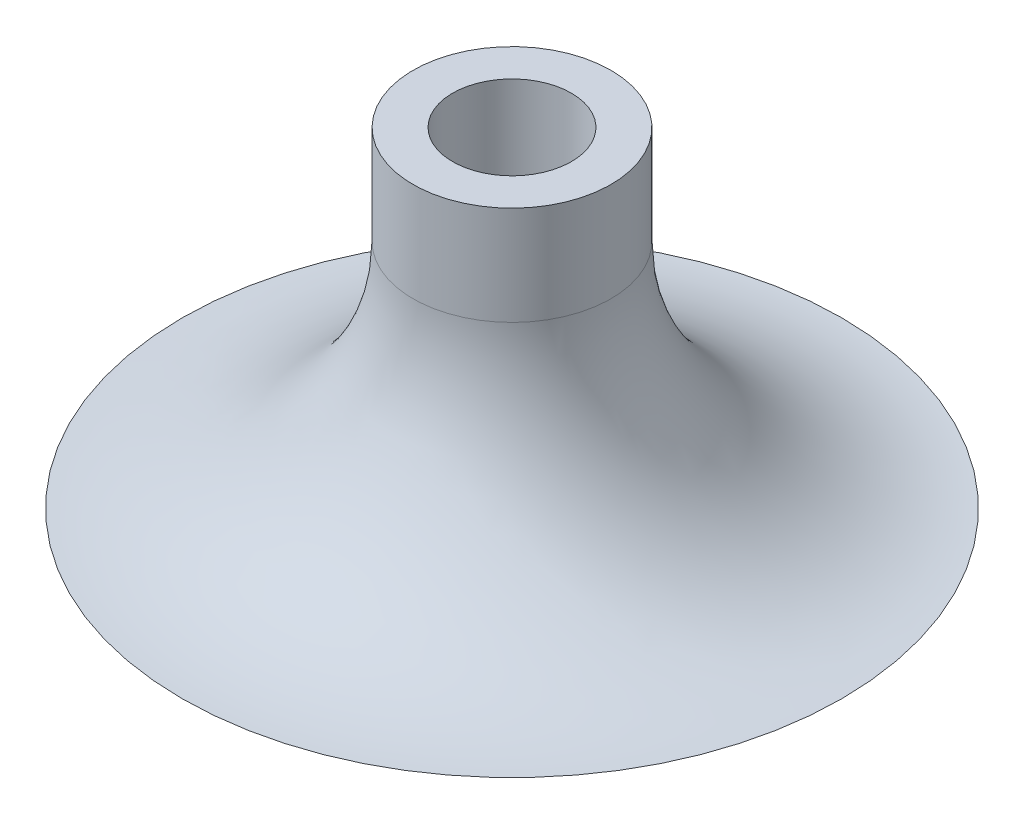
ISO-10303-21;
HEADER;
FILE_DESCRIPTION(('STEP AP214'),'2;1');
FILE_NAME('part.step','',(''),(''),'','','');
FILE_SCHEMA(('AUTOMOTIVE_DESIGN { 1 0 10303 214 1 1 1 1 }'));
ENDSEC;
DATA;
#1=APPLICATION_CONTEXT('core data for automotive mechanical design processes');
#2=APPLICATION_PROTOCOL_DEFINITION('international standard','automotive_design',2000,#1);
#3=PRODUCT_CONTEXT('',#1,'mechanical');
#4=PRODUCT('Part','Part','',(#3));
#5=PRODUCT_RELATED_PRODUCT_CATEGORY('part','',(#4));
#6=PRODUCT_DEFINITION_FORMATION('','',#4);
#7=PRODUCT_DEFINITION_CONTEXT('part definition',#1,'design');
#8=PRODUCT_DEFINITION('design','',#6,#7);
#9=PRODUCT_DEFINITION_SHAPE('','',#8);
#10=(LENGTH_UNIT() NAMED_UNIT(*) SI_UNIT(.MILLI.,.METRE.));
#11=(NAMED_UNIT(*) PLANE_ANGLE_UNIT() SI_UNIT($,.RADIAN.));
#12=(NAMED_UNIT(*) SI_UNIT($,.STERADIAN.) SOLID_ANGLE_UNIT());
#13=UNCERTAINTY_MEASURE_WITH_UNIT(LENGTH_MEASURE(1.E-05),#10,'distance_accuracy_value','');
#14=(GEOMETRIC_REPRESENTATION_CONTEXT(3) GLOBAL_UNCERTAINTY_ASSIGNED_CONTEXT((#13)) GLOBAL_UNIT_ASSIGNED_CONTEXT((#10,
#11,#12)) REPRESENTATION_CONTEXT('',''));
#15=CARTESIAN_POINT('',(0.,0.,0.));
#16=DIRECTION('',(0.,0.,1.));
#17=DIRECTION('',(1.,0.,0.));
#18=AXIS2_PLACEMENT_3D('',#15,#16,#17);
#19=CARTESIAN_POINT('',(0.,0.,0.));
#20=DIRECTION('',(0.,-1.,0.));
#21=DIRECTION('',(0.,0.,-0.999999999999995));
#22=AXIS2_PLACEMENT_3D('',#19,#20,#21);
#23=CYLINDRICAL_SURFACE('',#22,2.286);
#24=CARTESIAN_POINT('',(0.,16.51,0.));
#25=DIRECTION('',(0.,-1.,0.));
#26=DIRECTION('',(0.,0.,-0.999999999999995));
#27=AXIS2_PLACEMENT_3D('',#24,#25,#26);
#28=CIRCLE('',#27,2.286);
#29=CARTESIAN_POINT('',(0.,16.51,-2.28600000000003));
#30=VERTEX_POINT('',#29);
#31=EDGE_CURVE('E47',#30,#30,#28,.T.);
#32=ORIENTED_EDGE('',*,*,#31,.F.);
#33=EDGE_LOOP('',(#32));
#34=FACE_BOUND('',#33,.T.);
#35=CARTESIAN_POINT('',(0.,3.81000000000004,0.));
#36=DIRECTION('',(0.,-1.,0.));
#37=DIRECTION('',(0.,0.,-0.999999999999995));
#38=AXIS2_PLACEMENT_3D('',#35,#36,#37);
#39=CIRCLE('',#38,2.28599999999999);
#40=CARTESIAN_POINT('',(0.,3.81000000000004,-2.28599999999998));
#41=VERTEX_POINT('',#40);
#42=EDGE_CURVE('E10',#41,#41,#39,.T.);
#43=ORIENTED_EDGE('',*,*,#42,.T.);
#44=EDGE_LOOP('',(#43));
#45=FACE_BOUND('',#44,.T.);
#46=ADVANCED_FACE('F28',(#34,#45),#23,.F.);
#47=CARTESIAN_POINT('',(0.,3.81000000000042,12.6999999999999));
#48=DIRECTION('',(0.,1.,0.));
#49=DIRECTION('',(0.,0.,0.999999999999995));
#50=AXIS2_PLACEMENT_3D('',#47,#48,#49);
#51=PLANE('',#50);
#52=ORIENTED_EDGE('',*,*,#42,.F.);
#53=EDGE_LOOP('',(#52));
#54=FACE_BOUND('',#53,.T.);
#55=CARTESIAN_POINT('',(0.,3.81000000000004,0.));
#56=DIRECTION('',(0.,-1.,0.));
#57=DIRECTION('',(0.,0.,-0.999999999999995));
#58=AXIS2_PLACEMENT_3D('',#55,#56,#57);
#59=CIRCLE('',#58,12.7);
#60=CARTESIAN_POINT('',(0.,3.81000000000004,-12.6999999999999));
#61=VERTEX_POINT('',#60);
#62=EDGE_CURVE('E34',#61,#61,#59,.T.);
#63=ORIENTED_EDGE('',*,*,#62,.T.);
#64=EDGE_LOOP('',(#63));
#65=FACE_BOUND('',#64,.T.);
#66=ADVANCED_FACE('F54',(#54,#65),#51,.F.);
#67=CARTESIAN_POINT('',(0.,12.7,0.));
#68=DIRECTION('',(0.,-1.,0.));
#69=DIRECTION('',(0.,0.,-0.999999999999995));
#70=AXIS2_PLACEMENT_3D('',#67,#68,#69);
#71=TOROIDAL_SURFACE('',#70,12.7,8.89);
#72=ORIENTED_EDGE('',*,*,#62,.F.);
#73=EDGE_LOOP('',(#72));
#74=FACE_BOUND('',#73,.T.);
#75=CARTESIAN_POINT('',(0.,12.7,0.));
#76=DIRECTION('',(0.,-1.,0.));
#77=DIRECTION('',(0.,0.,-0.999999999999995));
#78=AXIS2_PLACEMENT_3D('',#75,#76,#77);
#79=CIRCLE('',#78,3.81);
#80=CARTESIAN_POINT('',(0.,12.7,-3.81000000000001));
#81=VERTEX_POINT('',#80);
#82=EDGE_CURVE('E38',#81,#81,#79,.T.);
#83=ORIENTED_EDGE('',*,*,#82,.T.);
#84=EDGE_LOOP('',(#83));
#85=FACE_BOUND('',#84,.T.);
#86=ADVANCED_FACE('F58',(#74,#85),#71,.F.);
#87=CARTESIAN_POINT('',(0.,0.,0.));
#88=DIRECTION('',(0.,-1.,0.));
#89=DIRECTION('',(0.,0.,-0.999999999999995));
#90=AXIS2_PLACEMENT_3D('',#87,#88,#89);
#91=CYLINDRICAL_SURFACE('',#90,3.81);
#92=ORIENTED_EDGE('',*,*,#82,.F.);
#93=EDGE_LOOP('',(#92));
#94=FACE_BOUND('',#93,.T.);
#95=CARTESIAN_POINT('',(0.,16.51,0.));
#96=DIRECTION('',(0.,-1.,0.));
#97=DIRECTION('',(0.,0.,-0.999999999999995));
#98=AXIS2_PLACEMENT_3D('',#95,#96,#97);
#99=CIRCLE('',#98,3.81);
#100=CARTESIAN_POINT('',(0.,16.51,-3.81000000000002));
#101=VERTEX_POINT('',#100);
#102=EDGE_CURVE('E42',#101,#101,#99,.T.);
#103=ORIENTED_EDGE('',*,*,#102,.T.);
#104=EDGE_LOOP('',(#103));
#105=FACE_BOUND('',#104,.T.);
#106=ADVANCED_FACE('F63',(#94,#105),#91,.T.);
#107=CARTESIAN_POINT('',(0.,16.51,3.80999999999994));
#108=DIRECTION('',(0.,-1.,0.));
#109=DIRECTION('',(0.,0.,-0.999999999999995));
#110=AXIS2_PLACEMENT_3D('',#107,#108,#109);
#111=PLANE('',#110);
#112=ORIENTED_EDGE('',*,*,#102,.F.);
#113=EDGE_LOOP('',(#112));
#114=FACE_BOUND('',#113,.T.);
#115=ORIENTED_EDGE('',*,*,#31,.T.);
#116=EDGE_LOOP('',(#115));
#117=FACE_BOUND('',#116,.T.);
#118=ADVANCED_FACE('F51',(#114,#117),#111,.F.);
#119=CLOSED_SHELL('',(#46,#66,#86,#106,#118));
#120=MANIFOLD_SOLID_BREP('B2',#119);
#121=ADVANCED_BREP_SHAPE_REPRESENTATION('',(#18,#120),#14);
#122=SHAPE_DEFINITION_REPRESENTATION(#9,#121);
ENDSEC;
END-ISO-10303-21;
